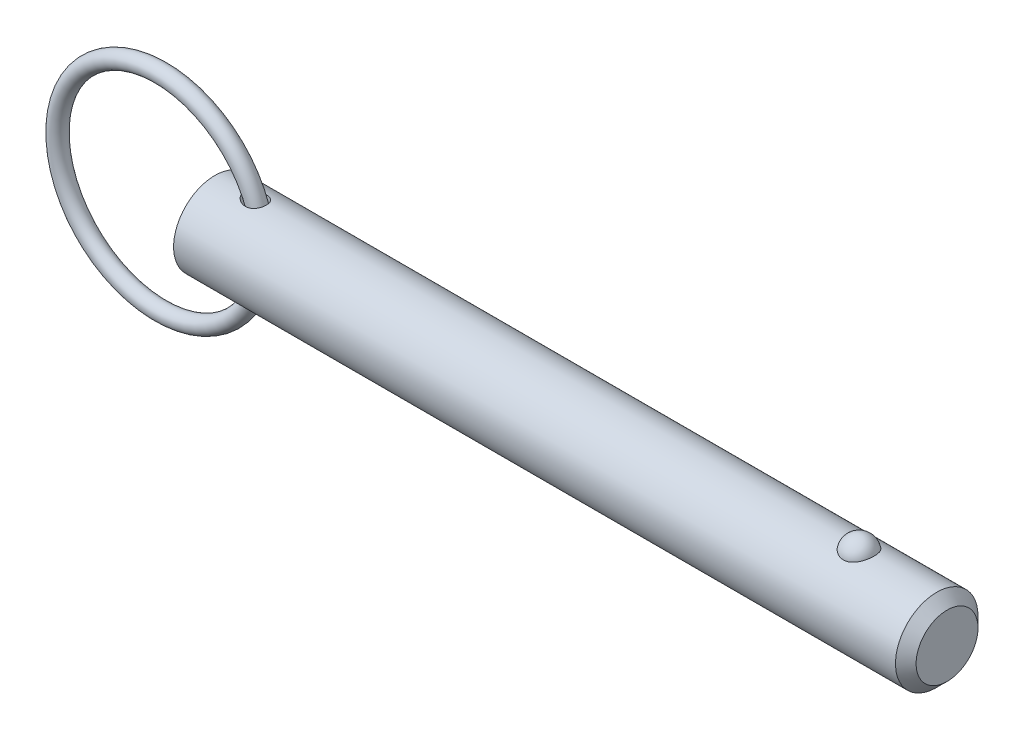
ISO-10303-21;
HEADER;
FILE_DESCRIPTION(('STEP AP214'),'2;1');
FILE_NAME('part.step','',(''),(''),'','','');
FILE_SCHEMA(('AUTOMOTIVE_DESIGN { 1 0 10303 214 1 1 1 1 }'));
ENDSEC;
DATA;
#1=APPLICATION_CONTEXT('core data for automotive mechanical design processes');
#2=APPLICATION_PROTOCOL_DEFINITION('international standard','automotive_design',2000,#1);
#3=PRODUCT_CONTEXT('',#1,'mechanical');
#4=PRODUCT('Part','Part','',(#3));
#5=PRODUCT_RELATED_PRODUCT_CATEGORY('part','',(#4));
#6=PRODUCT_DEFINITION_FORMATION('','',#4);
#7=PRODUCT_DEFINITION_CONTEXT('part definition',#1,'design');
#8=PRODUCT_DEFINITION('design','',#6,#7);
#9=PRODUCT_DEFINITION_SHAPE('','',#8);
#10=(LENGTH_UNIT() NAMED_UNIT(*) SI_UNIT(.MILLI.,.METRE.));
#11=(NAMED_UNIT(*) PLANE_ANGLE_UNIT() SI_UNIT($,.RADIAN.));
#12=(NAMED_UNIT(*) SI_UNIT($,.STERADIAN.) SOLID_ANGLE_UNIT());
#13=UNCERTAINTY_MEASURE_WITH_UNIT(LENGTH_MEASURE(1.E-05),#10,'distance_accuracy_value','');
#14=(GEOMETRIC_REPRESENTATION_CONTEXT(3) GLOBAL_UNCERTAINTY_ASSIGNED_CONTEXT((#13)) GLOBAL_UNIT_ASSIGNED_CONTEXT((#10,
#11,#12)) REPRESENTATION_CONTEXT('',''));
#15=CARTESIAN_POINT('',(0.,0.,0.));
#16=DIRECTION('',(0.,0.,1.));
#17=DIRECTION('',(1.,0.,0.));
#18=AXIS2_PLACEMENT_3D('',#15,#16,#17);
#19=CARTESIAN_POINT('',(-8.34703434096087,0.,0.));
#20=DIRECTION('',(0.,0.,1.));
#21=DIRECTION('',(1.,0.,0.));
#22=AXIS2_PLACEMENT_3D('',#19,#20,#21);
#23=TOROIDAL_SURFACE('',#22,15.875,1.27);
#24=CARTESIAN_POINT('',(8.79796565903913,0.,0.));
#25=VERTEX_POINT('',#24);
#26=VERTEX_LOOP('',#25);
#27=FACE_BOUND('',#26,.T.);
#28=ADVANCED_FACE('P0_F12',(#27),#23,.T.);
#29=CLOSED_SHELL('',(#28));
#30=MANIFOLD_SOLID_BREP('P0_B1',#29);
#31=CARTESIAN_POINT('',(0.,0.,0.));
#32=DIRECTION('',(1.,0.,0.));
#33=DIRECTION('',(0.,0.,-1.));
#34=AXIS2_PLACEMENT_3D('',#31,#32,#33);
#35=CYLINDRICAL_SURFACE('',#34,6.35);
#36=CARTESIAN_POINT('',(4.87230670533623,6.27273159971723,-0.987592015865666));
#37=CARTESIAN_POINT('',(4.94734735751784,6.26035058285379,-1.06623378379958));
#38=CARTESIAN_POINT('',(5.02968768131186,6.24755813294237,-1.13788608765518));
#39=CARTESIAN_POINT('',(5.2053426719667,6.22278258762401,-1.26640223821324));
#40=CARTESIAN_POINT('',(5.29867273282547,6.21080066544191,-1.32324497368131));
#41=CARTESIAN_POINT('',(5.49318962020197,6.18912414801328,-1.42117930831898));
#42=CARTESIAN_POINT('',(5.59435470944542,6.17942350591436,-1.46231273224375));
#43=CARTESIAN_POINT('',(5.80219659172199,6.16352555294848,-1.52793951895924));
#44=CARTESIAN_POINT('',(5.90887152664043,6.15732706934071,-1.55243845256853));
#45=CARTESIAN_POINT('',(6.12818220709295,6.14931784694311,-1.58387975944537));
#46=CARTESIAN_POINT('',(6.24090110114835,6.14763959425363,-1.59029227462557));
#47=CARTESIAN_POINT('',(6.46560233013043,6.14965588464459,-1.58248630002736));
#48=CARTESIAN_POINT('',(6.57758514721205,6.15334646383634,-1.56828303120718));
#49=CARTESIAN_POINT('',(6.78516594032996,6.1652116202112,-1.52091398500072));
#50=CARTESIAN_POINT('',(6.88126802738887,6.17288876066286,-1.48983713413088));
#51=CARTESIAN_POINT('',(7.06576629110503,6.19149190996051,-1.41052329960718));
#52=CARTESIAN_POINT('',(7.15416739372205,6.20241582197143,-1.36229738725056));
#53=CARTESIAN_POINT('',(7.31166929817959,6.2248616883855,-1.25548983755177));
#54=CARTESIAN_POINT('',(7.38181442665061,6.23621734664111,-1.19840625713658));
#55=CARTESIAN_POINT('',(7.51101296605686,6.259037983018,-1.07284763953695));
#56=CARTESIAN_POINT('',(7.57006844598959,6.2705029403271,-1.00437473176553));
#57=CARTESIAN_POINT('',(7.6737469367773,6.29184873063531,-0.860384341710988));
#58=CARTESIAN_POINT('',(7.71876694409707,6.30176816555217,-0.785157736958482));
#59=CARTESIAN_POINT('',(7.79574491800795,6.31935829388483,-0.628053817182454));
#60=CARTESIAN_POINT('',(7.82770308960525,6.32702902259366,-0.546176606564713));
#61=CARTESIAN_POINT('',(7.87788845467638,6.33930929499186,-0.377876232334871));
#62=CARTESIAN_POINT('',(7.89608106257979,6.34391112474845,-0.291442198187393));
#63=CARTESIAN_POINT('',(7.91820729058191,6.34953044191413,-0.116652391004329));
#64=CARTESIAN_POINT('',(7.9221404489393,6.35054781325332,-0.0282965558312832));
#65=CARTESIAN_POINT('',(7.91564686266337,6.34888556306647,0.148263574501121));
#66=CARTESIAN_POINT('',(7.90515337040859,6.34618875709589,0.236465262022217));
#67=CARTESIAN_POINT('',(7.8699153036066,6.33735741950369,0.409798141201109));
#68=CARTESIAN_POINT('',(7.84517062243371,6.33122286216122,0.494929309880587));
#69=CARTESIAN_POINT('',(7.7819985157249,6.31618517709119,0.659657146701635));
#70=CARTESIAN_POINT('',(7.74357645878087,6.30728313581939,0.739255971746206));
#71=CARTESIAN_POINT('',(7.65396632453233,6.28769050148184,0.890663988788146));
#72=CARTESIAN_POINT('',(7.60277911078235,6.27700002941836,0.962473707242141));
#73=CARTESIAN_POINT('',(7.48925881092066,6.2550822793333,1.09590260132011));
#74=CARTESIAN_POINT('',(7.42698604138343,6.24385813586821,1.15757361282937));
#75=CARTESIAN_POINT('',(7.29283556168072,6.2220655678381,1.26951234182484));
#76=CARTESIAN_POINT('',(7.2209588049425,6.21149707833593,1.31978118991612));
#77=CARTESIAN_POINT('',(7.06971853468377,6.19216002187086,1.40772509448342));
#78=CARTESIAN_POINT('',(6.99035873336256,6.18339056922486,1.44540635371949));
#79=CARTESIAN_POINT('',(6.82642723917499,6.16851603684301,1.50762653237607));
#80=CARTESIAN_POINT('',(6.7418548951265,6.16241129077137,1.53216380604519));
#81=CARTESIAN_POINT('',(6.56686412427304,6.15321474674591,1.56869994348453));
#82=CARTESIAN_POINT('',(6.47634467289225,6.15023369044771,1.58023897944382));
#83=CARTESIAN_POINT('',(6.29456956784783,6.14778331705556,1.58974172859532));
#84=CARTESIAN_POINT('',(6.20331368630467,6.1483151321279,1.58770106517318));
#85=CARTESIAN_POINT('',(6.01385969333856,6.15284811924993,1.5700487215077));
#86=CARTESIAN_POINT('',(5.91578322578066,6.15715979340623,1.55322212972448));
#87=CARTESIAN_POINT('',(5.72331909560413,6.16902415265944,1.5054032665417));
#88=CARTESIAN_POINT('',(5.6289344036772,6.17657939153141,1.4743998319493));
#89=CARTESIAN_POINT('',(5.4357260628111,6.19502494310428,1.39499475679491));
#90=CARTESIAN_POINT('',(5.33755891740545,6.20619097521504,1.34505268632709));
#91=CARTESIAN_POINT('',(5.15090047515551,6.23006191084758,1.22975103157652));
#92=CARTESIAN_POINT('',(5.06240741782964,6.24276653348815,1.16439425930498));
#93=CARTESIAN_POINT('',(4.91171642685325,6.26607433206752,1.03083814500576));
#94=CARTESIAN_POINT('',(4.84758224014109,6.27668356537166,0.964825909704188));
#95=CARTESIAN_POINT('',(4.73090054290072,6.29683133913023,0.823112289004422));
#96=CARTESIAN_POINT('',(4.67833688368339,6.30637136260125,0.747424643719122));
#97=CARTESIAN_POINT('',(4.59543145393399,6.32183254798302,0.601150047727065));
#98=CARTESIAN_POINT('',(4.56283099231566,6.32809321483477,0.531883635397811));
#99=CARTESIAN_POINT('',(4.50941370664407,6.33849198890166,0.388778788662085));
#100=CARTESIAN_POINT('',(4.48858876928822,6.34263155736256,0.314943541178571));
#101=CARTESIAN_POINT('',(4.46008864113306,6.3483236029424,0.164282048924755));
#102=CARTESIAN_POINT('',(4.45247558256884,6.34986385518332,0.08744340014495));
#103=CARTESIAN_POINT('',(4.45121096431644,6.35011863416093,-0.0663538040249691));
#104=CARTESIAN_POINT('',(4.45755802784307,6.34883343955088,-0.143312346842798));
#105=CARTESIAN_POINT('',(4.48267656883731,6.34380948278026,-0.288945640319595));
#106=CARTESIAN_POINT('',(4.50045680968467,6.34026665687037,-0.357802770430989));
#107=CARTESIAN_POINT('',(4.54636050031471,6.33128211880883,-0.491815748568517));
#108=CARTESIAN_POINT('',(4.57448566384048,6.32584009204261,-0.556970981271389));
#109=CARTESIAN_POINT('',(4.64209700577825,6.31308107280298,-0.687092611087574));
#110=CARTESIAN_POINT('',(4.68226903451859,6.30565525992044,-0.751689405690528));
#111=CARTESIAN_POINT('',(4.77120834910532,6.28979741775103,-0.874524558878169));
#112=CARTESIAN_POINT('',(4.81998302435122,6.28136452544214,-0.932757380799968));
#113=CARTESIAN_POINT('',(4.87230670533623,6.27273159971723,-0.987592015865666));
#114=B_SPLINE_CURVE_WITH_KNOTS('',3,(#36,#37,#38,#39,#40,#41,#42,#43,#44,#45,#46,#47,#48,#49,
#50,#51,#52,#53,#54,#55,#56,#57,#58,#59,#60,#61,#62,#63,#64,#65,#66,#67,#68,#69,#70,#71,#72,#73,
#74,#75,#76,#77,#78,#79,#80,#81,#82,#83,#84,#85,#86,#87,#88,#89,#90,#91,#92,#93,#94,#95,#96,#97,
#98,#99,#100,#101,#102,#103,#104,#105,#106,#107,#108,#109,#110,#111,#112,#113),.UNSPECIFIED.,
.T.,.F.,(4,2,2,2,2,2,2,2,2,2,2,2,2,2,2,2,2,2,2,2,2,2,2,2,2,2,2,2,2,2,2,2,2,2,2,2,2,2,4),(0.,
0.327902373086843,0.65626964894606,0.983756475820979,1.31113357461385,1.64800657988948,
1.98463099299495,2.28681225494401,2.58879878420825,2.86088594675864,3.13292229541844,
3.3963648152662,3.65980320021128,3.92390128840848,4.18800792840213,4.45334062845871,
4.7186753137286,4.98390596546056,5.24911867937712,5.51293017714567,5.7767155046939,
6.04037065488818,6.30405880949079,6.57680801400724,6.84964512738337,7.14724526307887,
7.44508014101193,7.77572668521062,8.10631295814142,8.38318772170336,8.65967357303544,
8.88915303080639,9.11847418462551,9.34887088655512,9.57924486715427,9.79193291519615,
10.0046562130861,10.2330958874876,10.4617327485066),.UNSPECIFIED.);
#115=CARTESIAN_POINT('',(4.87230670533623,6.27273159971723,-0.987592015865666));
#116=VERTEX_POINT('',#115);
#117=EDGE_CURVE('P1_E40',#116,#116,#114,.T.);
#118=ORIENTED_EDGE('',*,*,#117,.T.);
#119=EDGE_LOOP('',(#118));
#120=FACE_BOUND('',#119,.T.);
#121=CARTESIAN_POINT('',(111.1125,0.,0.));
#122=DIRECTION('',(1.,0.,0.));
#123=DIRECTION('',(0.,0.,-1.));
#124=AXIS2_PLACEMENT_3D('',#121,#122,#123);
#125=CIRCLE('',#124,6.35);
#126=CARTESIAN_POINT('',(111.1125,0.,-6.35));
#127=VERTEX_POINT('',#126);
#128=EDGE_CURVE('P1_E25',#127,#127,#125,.T.);
#129=ORIENTED_EDGE('',*,*,#128,.F.);
#130=EDGE_LOOP('',(#129));
#131=FACE_BOUND('',#130,.T.);
#132=CARTESIAN_POINT('',(0.,0.,0.));
#133=DIRECTION('',(1.,0.,0.));
#134=DIRECTION('',(0.,0.,-1.));
#135=AXIS2_PLACEMENT_3D('',#132,#133,#134);
#136=CIRCLE('',#135,6.35);
#137=CARTESIAN_POINT('',(0.,0.,-6.35));
#138=VERTEX_POINT('',#137);
#139=EDGE_CURVE('P1_E9',#138,#138,#136,.T.);
#140=ORIENTED_EDGE('',*,*,#139,.T.);
#141=EDGE_LOOP('',(#140));
#142=FACE_BOUND('',#141,.T.);
#143=CARTESIAN_POINT('',(99.1500214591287,5.87502187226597,2.40969251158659));
#144=CARTESIAN_POINT('',(99.0250305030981,5.87501645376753,2.40969773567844));
#145=CARTESIAN_POINT('',(98.9000806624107,5.87916061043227,2.39967292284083));
#146=CARTESIAN_POINT('',(98.6539091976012,5.8952311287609,2.35991730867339));
#147=CARTESIAN_POINT('',(98.5326863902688,5.90715499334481,2.33019283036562));
#148=CARTESIAN_POINT('',(98.2975170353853,5.93739567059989,2.25201402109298));
#149=CARTESIAN_POINT('',(98.1835602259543,5.95570321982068,2.2035868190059));
#150=CARTESIAN_POINT('',(97.96557352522,5.99672067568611,2.08937987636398));
#151=CARTESIAN_POINT('',(97.8615457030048,6.01943149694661,2.02359652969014));
#152=CARTESIAN_POINT('',(97.6629437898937,6.06760647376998,1.87428969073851));
#153=CARTESIAN_POINT('',(97.5687268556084,6.09313095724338,1.79031110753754));
#154=CARTESIAN_POINT('',(97.3952557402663,6.14375873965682,1.60800178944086));
#155=CARTESIAN_POINT('',(97.3160043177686,6.16886196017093,1.50966841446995));
#156=CARTESIAN_POINT('',(97.1708457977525,6.21724600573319,1.29645884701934));
#157=CARTESIAN_POINT('',(97.1056885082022,6.24039621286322,1.18104158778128));
#158=CARTESIAN_POINT('',(96.9947035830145,6.28117277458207,0.940351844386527));
#159=CARTESIAN_POINT('',(96.9488776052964,6.29879865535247,0.815078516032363));
#160=CARTESIAN_POINT('',(96.8770234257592,6.32692073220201,0.556494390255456));
#161=CARTESIAN_POINT('',(96.851249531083,6.33732517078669,0.423102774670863));
#162=CARTESIAN_POINT('',(96.8209885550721,6.34957673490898,0.153542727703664));
#163=CARTESIAN_POINT('',(96.8165009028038,6.35142408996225,0.0173743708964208));
#164=CARTESIAN_POINT('',(96.8288655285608,6.34638925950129,-0.253036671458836));
#165=CARTESIAN_POINT('',(96.8455949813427,6.33955731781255,-0.38728593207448));
#166=CARTESIAN_POINT('',(96.899843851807,6.31794129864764,-0.650851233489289));
#167=CARTESIAN_POINT('',(96.9373636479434,6.30315707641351,-0.78016718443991));
#168=CARTESIAN_POINT('',(97.032500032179,6.26711642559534,-1.03041949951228));
#169=CARTESIAN_POINT('',(97.090143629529,6.24585130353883,-1.15134433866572));
#170=CARTESIAN_POINT('',(97.2243522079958,6.19905619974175,-1.38129800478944));
#171=CARTESIAN_POINT('',(97.3009187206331,6.17352587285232,-1.49032586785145));
#172=CARTESIAN_POINT('',(97.4717538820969,6.12080227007,-1.69393164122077));
#173=CARTESIAN_POINT('',(97.5661008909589,6.09360200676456,-1.78844209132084));
#174=CARTESIAN_POINT('',(97.7701196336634,6.04070434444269,-1.95970536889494));
#175=CARTESIAN_POINT('',(97.8797900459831,6.01500681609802,-2.03645972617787));
#176=CARTESIAN_POINT('',(98.1091876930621,5.96867714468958,-2.1684564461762));
#177=CARTESIAN_POINT('',(98.2286522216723,5.94794910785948,-2.2241206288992));
#178=CARTESIAN_POINT('',(98.4762188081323,5.91340580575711,-2.31440992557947));
#179=CARTESIAN_POINT('',(98.6043175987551,5.89958794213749,-2.3490429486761));
#180=CARTESIAN_POINT('',(98.858582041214,5.88111049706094,-2.39491590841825));
#181=CARTESIAN_POINT('',(98.9845207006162,5.876025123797,-2.40724512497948));
#182=CARTESIAN_POINT('',(99.2367867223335,5.87428980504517,-2.41147867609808));
#183=CARTESIAN_POINT('',(99.363114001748,5.87763817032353,-2.40338710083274));
#184=CARTESIAN_POINT('',(99.6084170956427,5.89212921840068,-2.36762715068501));
#185=CARTESIAN_POINT('',(99.7274992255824,5.90302431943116,-2.34058030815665));
#186=CARTESIAN_POINT('',(99.9592447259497,5.93113752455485,-2.26839066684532));
#187=CARTESIAN_POINT('',(100.071907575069,5.94835614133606,-2.22324640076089));
#188=CARTESIAN_POINT('',(100.290400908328,5.98773016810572,-2.11493806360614));
#189=CARTESIAN_POINT('',(100.396028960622,6.00998499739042,-2.05140269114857));
#190=CARTESIAN_POINT('',(100.595300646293,6.05690144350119,-1.90842705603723));
#191=CARTESIAN_POINT('',(100.688941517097,6.08156361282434,-1.8289831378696));
#192=CARTESIAN_POINT('',(100.866675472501,6.13211715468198,-1.65182429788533));
#193=CARTESIAN_POINT('',(100.950055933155,6.15800825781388,-1.55339381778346));
#194=CARTESIAN_POINT('',(101.099790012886,6.20712834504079,-1.34374214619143));
#195=CARTESIAN_POINT('',(101.166140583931,6.23035685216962,-1.23251867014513));
#196=CARTESIAN_POINT('',(101.282345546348,6.27251177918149,-0.996447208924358));
#197=CARTESIAN_POINT('',(101.331607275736,6.29127762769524,-0.871278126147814));
#198=CARTESIAN_POINT('',(101.409614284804,6.3215862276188,-0.613870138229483));
#199=CARTESIAN_POINT('',(101.438359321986,6.33312889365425,-0.481631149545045));
#200=CARTESIAN_POINT('',(101.47477058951,6.34782349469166,-0.213672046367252));
#201=CARTESIAN_POINT('',(101.482413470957,6.35096613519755,-0.0779482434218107));
#202=CARTESIAN_POINT('',(101.476395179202,6.34851322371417,0.192943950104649));
#203=CARTESIAN_POINT('',(101.462734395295,6.3429178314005,0.32811235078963));
#204=CARTESIAN_POINT('',(101.41450361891,6.32360512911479,0.593406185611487));
#205=CARTESIAN_POINT('',(101.380031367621,6.30992579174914,0.723552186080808));
#206=CARTESIAN_POINT('',(101.290953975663,6.27586325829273,0.975834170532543));
#207=CARTESIAN_POINT('',(101.23634761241,6.25547965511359,1.09796966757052));
#208=CARTESIAN_POINT('',(101.10775879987,6.20998183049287,1.33148921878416));
#209=CARTESIAN_POINT('',(101.033674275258,6.18484288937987,1.44281227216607));
#210=CARTESIAN_POINT('',(100.867820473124,6.13258735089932,1.65087683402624));
#211=CARTESIAN_POINT('',(100.776051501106,6.10547078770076,1.74761859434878));
#212=CARTESIAN_POINT('',(100.577183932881,6.0523587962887,1.92350926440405));
#213=CARTESIAN_POINT('',(100.470133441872,6.0263601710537,2.00271146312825));
#214=CARTESIAN_POINT('',(100.243138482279,5.97843747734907,2.14154159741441));
#215=CARTESIAN_POINT('',(100.123191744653,5.95651412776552,2.20116608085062));
#216=CARTESIAN_POINT('',(99.8645236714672,5.91812106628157,2.30250570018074));
#217=CARTESIAN_POINT('',(99.7250698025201,5.90217533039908,2.34256795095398));
#218=CARTESIAN_POINT('',(99.4403974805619,5.88063128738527,2.39615214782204));
#219=CARTESIAN_POINT('',(99.2951817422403,5.8750281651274,2.40968644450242));
#220=CARTESIAN_POINT('',(99.1500214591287,5.87502187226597,2.40969251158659));
#221=B_SPLINE_CURVE_WITH_KNOTS('',3,(#143,#144,#145,#146,#147,#148,#149,#150,#151,#152,#153,
#154,#155,#156,#157,#158,#159,#160,#161,#162,#163,#164,#165,#166,#167,#168,#169,#170,#171,#172,
#173,#174,#175,#176,#177,#178,#179,#180,#181,#182,#183,#184,#185,#186,#187,#188,#189,#190,#191,
#192,#193,#194,#195,#196,#197,#198,#199,#200,#201,#202,#203,#204,#205,#206,#207,#208,#209,#210,
#211,#212,#213,#214,#215,#216,#217,#218,#219,#220),.UNSPECIFIED.,.T.,.F.,(4,2,2,2,2,2,2,2,2,2,2,
2,2,2,2,2,2,2,2,2,2,2,2,2,2,2,2,2,2,2,2,2,2,2,2,2,2,2,4),(0.,0.374440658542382,
0.748761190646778,1.12254078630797,1.49639810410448,1.88098871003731,2.26565013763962,
2.66741104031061,3.06920639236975,3.47601794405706,3.88281858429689,4.28727498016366,
4.69173873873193,5.09674745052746,5.50178895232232,5.90865911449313,6.31549420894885,
6.71369855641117,7.11175305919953,7.48978077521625,7.86773278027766,8.23383886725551,
8.59997464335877,8.97409044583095,9.34829231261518,9.74122667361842,10.1342313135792,
10.5397522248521,10.9452779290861,11.3512521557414,11.7572189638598,12.1612938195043,
12.5653932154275,12.9716540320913,13.3779078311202,13.7829098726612,14.1879832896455,
14.6230486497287,15.0579114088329),.UNSPECIFIED.);
#222=CARTESIAN_POINT('',(99.1500214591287,5.87502187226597,2.40969251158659));
#223=VERTEX_POINT('',#222);
#224=EDGE_CURVE('P1_E34',#223,#223,#221,.T.);
#225=ORIENTED_EDGE('',*,*,#224,.T.);
#226=EDGE_LOOP('',(#225));
#227=FACE_BOUND('',#226,.T.);
#228=CARTESIAN_POINT('',(4.87230670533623,-6.27273159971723,-0.987592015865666));
#229=CARTESIAN_POINT('',(4.81440819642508,-6.28228431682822,-0.926913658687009));
#230=CARTESIAN_POINT('',(4.76085022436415,-6.29159289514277,-0.862071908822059));
#231=CARTESIAN_POINT('',(4.66448472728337,-6.3088950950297,-0.72465504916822));
#232=CARTESIAN_POINT('',(4.62166818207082,-6.31688981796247,-0.652086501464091));
#233=CARTESIAN_POINT('',(4.54882773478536,-6.33076917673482,-0.49974775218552));
#234=CARTESIAN_POINT('',(4.51891553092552,-6.33663532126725,-0.419921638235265));
#235=CARTESIAN_POINT('',(4.47476924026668,-6.3453711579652,-0.255882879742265));
#236=CARTESIAN_POINT('',(4.46051880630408,-6.34824397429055,-0.171674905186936));
#237=CARTESIAN_POINT('',(4.44966179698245,-6.35043041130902,-0.0120763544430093));
#238=CARTESIAN_POINT('',(4.45117530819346,-6.35012328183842,0.0631849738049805));
#239=CARTESIAN_POINT('',(4.46726452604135,-6.34689000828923,0.212230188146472));
#240=CARTESIAN_POINT('',(4.48184026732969,-6.3439638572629,0.286014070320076));
#241=CARTESIAN_POINT('',(4.52202068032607,-6.33603071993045,0.426550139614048));
#242=CARTESIAN_POINT('',(4.54707079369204,-6.33112875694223,0.493469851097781));
#243=CARTESIAN_POINT('',(4.6066985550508,-6.31972370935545,0.622743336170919));
#244=CARTESIAN_POINT('',(4.64127887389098,-6.31322017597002,0.685095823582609));
#245=CARTESIAN_POINT('',(4.72328142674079,-6.29826068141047,0.811769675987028));
#246=CARTESIAN_POINT('',(4.77176118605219,-6.28966287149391,0.875386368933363));
#247=CARTESIAN_POINT('',(4.87703902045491,-6.27182325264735,0.99519278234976));
#248=CARTESIAN_POINT('',(4.93384225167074,-6.26258104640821,1.05137785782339));
#249=CARTESIAN_POINT('',(5.06617436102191,-6.24228878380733,1.16635591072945));
#250=CARTESIAN_POINT('',(5.14318167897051,-6.23124423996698,1.22345054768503));
#251=CARTESIAN_POINT('',(5.30475767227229,-6.21023402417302,1.32598441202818));
#252=CARTESIAN_POINT('',(5.38933237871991,-6.20026922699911,1.37141422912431));
#253=CARTESIAN_POINT('',(5.5776013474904,-6.18099350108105,1.45601817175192));
#254=CARTESIAN_POINT('',(5.68224348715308,-6.17201456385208,1.4931788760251));
#255=CARTESIAN_POINT('',(5.89649087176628,-6.15800474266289,1.5499484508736));
#256=CARTESIAN_POINT('',(6.0060970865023,-6.15297463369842,1.56955387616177));
#257=CARTESIAN_POINT('',(6.22752772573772,-6.14779725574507,1.58971993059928));
#258=CARTESIAN_POINT('',(6.33935715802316,-6.14766266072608,1.59023112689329));
#259=CARTESIAN_POINT('',(6.56108231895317,-6.15269227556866,1.57066564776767));
#260=CARTESIAN_POINT('',(6.67097982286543,-6.15785133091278,1.55060899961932));
#261=CARTESIAN_POINT('',(6.87257705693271,-6.17211580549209,1.4927326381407));
#262=CARTESIAN_POINT('',(6.96494608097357,-6.18072242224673,1.45711948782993));
#263=CARTESIAN_POINT('',(7.14129343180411,-6.20069920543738,1.36960980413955));
#264=CARTESIAN_POINT('',(7.22527609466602,-6.21206793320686,1.31772174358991));
#265=CARTESIAN_POINT('',(7.37471505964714,-6.23497047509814,1.20443359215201));
#266=CARTESIAN_POINT('',(7.44115811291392,-6.24639757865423,1.14430788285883));
#267=CARTESIAN_POINT('',(7.56261868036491,-6.26896339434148,1.0134084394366));
#268=CARTESIAN_POINT('',(7.61763801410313,-6.28010215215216,0.942636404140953));
#269=CARTESIAN_POINT('',(7.71360563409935,-6.30055923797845,0.794304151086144));
#270=CARTESIAN_POINT('',(7.75485562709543,-6.3099143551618,0.716943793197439));
#271=CARTESIAN_POINT('',(7.82406051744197,-6.32610528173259,0.556244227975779));
#272=CARTESIAN_POINT('',(7.85201540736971,-6.33294108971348,0.472905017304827));
#273=CARTESIAN_POINT('',(7.89408663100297,-6.34338077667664,0.302249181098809));
#274=CARTESIAN_POINT('',(7.90814615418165,-6.34697138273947,0.214917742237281));
#275=CARTESIAN_POINT('',(7.92192329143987,-6.35048887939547,0.0390564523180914));
#276=CARTESIAN_POINT('',(7.92164046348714,-6.3504156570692,-0.0494734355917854));
#277=CARTESIAN_POINT('',(7.90670754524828,-6.34660520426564,-0.225592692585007));
#278=CARTESIAN_POINT('',(7.89199989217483,-6.34285329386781,-0.31317687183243));
#279=CARTESIAN_POINT('',(7.8484534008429,-6.33206809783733,-0.484549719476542));
#280=CARTESIAN_POINT('',(7.81961455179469,-6.32503480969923,-0.568338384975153));
#281=CARTESIAN_POINT('',(7.74850591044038,-6.30846389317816,-0.729625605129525));
#282=CARTESIAN_POINT('',(7.70625193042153,-6.29892921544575,-0.807131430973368));
#283=CARTESIAN_POINT('',(7.60933437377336,-6.27840608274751,-0.953731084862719));
#284=CARTESIAN_POINT('',(7.55467181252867,-6.2674177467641,-1.02282560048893));
#285=CARTESIAN_POINT('',(7.43471786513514,-6.24527869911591,-1.15028913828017));
#286=CARTESIAN_POINT('',(7.36948829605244,-6.23412925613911,-1.20871657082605));
#287=CARTESIAN_POINT('',(7.2300172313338,-6.21283678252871,-1.3137894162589));
#288=CARTESIAN_POINT('',(7.15577649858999,-6.20269366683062,-1.36043582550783));
#289=CARTESIAN_POINT('',(7.00025986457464,-6.18446636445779,-1.4410399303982));
#290=CARTESIAN_POINT('',(6.91896776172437,-6.17638709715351,-1.47496739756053));
#291=CARTESIAN_POINT('',(6.75184232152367,-6.16309237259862,-1.52957024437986));
#292=CARTESIAN_POINT('',(6.66600814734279,-6.15787744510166,-1.55024317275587));
#293=CARTESIAN_POINT('',(6.48842585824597,-6.15055064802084,-1.57906962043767));
#294=CARTESIAN_POINT('',(6.39658108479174,-6.14857915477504,-1.58665744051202));
#295=CARTESIAN_POINT('',(6.21279832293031,-6.14817707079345,-1.58821048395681));
#296=CARTESIAN_POINT('',(6.12086031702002,-6.14974736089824,-1.58217231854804));
#297=CARTESIAN_POINT('',(5.92996902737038,-6.15640095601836,-1.55609403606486));
#298=CARTESIAN_POINT('',(5.83120653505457,-6.16181208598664,-1.53474519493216));
#299=CARTESIAN_POINT('',(5.63804881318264,-6.17573474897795,-1.47771859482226));
#300=CARTESIAN_POINT('',(5.54365953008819,-6.18425037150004,-1.44202192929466));
#301=CARTESIAN_POINT('',(5.34413923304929,-6.20522938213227,-1.34918979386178));
#302=CARTESIAN_POINT('',(5.24033140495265,-6.21813417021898,-1.28928337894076));
#303=CARTESIAN_POINT('',(5.04554233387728,-6.24510162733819,-1.15156760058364));
#304=CARTESIAN_POINT('',(4.9545459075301,-6.25916289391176,-1.07377972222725));
#305=CARTESIAN_POINT('',(4.87230670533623,-6.27273159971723,-0.987592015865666));
#306=B_SPLINE_CURVE_WITH_KNOTS('',3,(#228,#229,#230,#231,#232,#233,#234,#235,#236,#237,#238,
#239,#240,#241,#242,#243,#244,#245,#246,#247,#248,#249,#250,#251,#252,#253,#254,#255,#256,#257,
#258,#259,#260,#261,#262,#263,#264,#265,#266,#267,#268,#269,#270,#271,#272,#273,#274,#275,#276,
#277,#278,#279,#280,#281,#282,#283,#284,#285,#286,#287,#288,#289,#290,#291,#292,#293,#294,#295,
#296,#297,#298,#299,#300,#301,#302,#303,#304,#305),.UNSPECIFIED.,.T.,.F.,(4,2,2,2,2,2,2,2,2,2,2,
2,2,2,2,2,2,2,2,2,2,2,2,2,2,2,2,2,2,2,2,2,2,2,2,2,2,2,4),(0.,0.252951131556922,
0.505689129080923,0.760572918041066,1.01519041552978,1.23982791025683,1.46446600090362,
1.67847364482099,1.89254132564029,2.13299551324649,2.37359928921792,2.6619896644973,
2.95061196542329,3.28329078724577,3.61603488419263,3.9496403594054,4.28292130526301,
4.57939201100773,4.87570862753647,5.14538810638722,5.41502459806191,5.67829123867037,
5.94155802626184,6.20589676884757,6.47024365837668,6.73564974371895,7.00105603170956,
7.26615064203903,7.53122356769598,7.79479837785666,8.05835088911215,8.32252586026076,
8.58674967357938,8.86213419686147,9.137587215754,9.43991696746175,9.74264642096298,
10.1023688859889,10.461661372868),.UNSPECIFIED.);
#307=CARTESIAN_POINT('',(4.87230670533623,-6.27273159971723,-0.987592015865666));
#308=VERTEX_POINT('',#307);
#309=EDGE_CURVE('P1_E17',#308,#308,#306,.T.);
#310=ORIENTED_EDGE('',*,*,#309,.T.);
#311=EDGE_LOOP('',(#310));
#312=FACE_BOUND('',#311,.T.);
#313=ADVANCED_FACE('P1_F13',(#120,#131,#142,#227,#312),#35,.T.);
#314=CARTESIAN_POINT('',(0.,0.,0.));
#315=DIRECTION('',(-1.,0.,0.));
#316=DIRECTION('',(0.,0.,1.));
#317=AXIS2_PLACEMENT_3D('',#314,#315,#316);
#318=PLANE('',#317);
#319=ORIENTED_EDGE('',*,*,#139,.F.);
#320=EDGE_LOOP('',(#319));
#321=FACE_BOUND('',#320,.T.);
#322=ADVANCED_FACE('P1_F15',(#321),#318,.T.);
#323=CARTESIAN_POINT('',(112.7,0.,0.));
#324=DIRECTION('',(-1.,0.,0.));
#325=DIRECTION('',(0.,0.,1.));
#326=AXIS2_PLACEMENT_3D('',#323,#324,#325);
#327=CONICAL_SURFACE('',#326,4.76250000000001,0.785398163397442);
#328=ORIENTED_EDGE('',*,*,#128,.T.);
#329=EDGE_LOOP('',(#328));
#330=FACE_BOUND('',#329,.T.);
#331=CARTESIAN_POINT('',(112.7,0.,0.));
#332=DIRECTION('',(1.,0.,0.));
#333=DIRECTION('',(0.,0.,-1.));
#334=AXIS2_PLACEMENT_3D('',#331,#332,#333);
#335=CIRCLE('',#334,4.76250000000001);
#336=CARTESIAN_POINT('',(112.7,0.,-4.76250000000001));
#337=VERTEX_POINT('',#336);
#338=EDGE_CURVE('P1_E30',#337,#337,#335,.T.);
#339=ORIENTED_EDGE('',*,*,#338,.F.);
#340=EDGE_LOOP('',(#339));
#341=FACE_BOUND('',#340,.T.);
#342=ADVANCED_FACE('P1_F55',(#330,#341),#327,.T.);
#343=CARTESIAN_POINT('',(112.7,4.76250000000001,0.));
#344=DIRECTION('',(1.,0.,0.));
#345=DIRECTION('',(0.,0.,-1.));
#346=AXIS2_PLACEMENT_3D('',#343,#344,#345);
#347=PLANE('',#346);
#348=ORIENTED_EDGE('',*,*,#338,.T.);
#349=EDGE_LOOP('',(#348));
#350=FACE_BOUND('',#349,.T.);
#351=ADVANCED_FACE('P1_F51',(#350),#347,.T.);
#352=CARTESIAN_POINT('',(99.1500214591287,5.715,0.));
#353=DIRECTION('',(-1.,0.,0.));
#354=DIRECTION('',(0.,1.,0.));
#355=AXIS2_PLACEMENT_3D('',#352,#353,#354);
#356=SPHERICAL_SURFACE('',#355,2.415);
#357=ORIENTED_EDGE('',*,*,#224,.F.);
#358=EDGE_LOOP('',(#357));
#359=FACE_BOUND('',#358,.T.);
#360=ADVANCED_FACE('P1_F46',(#359),#356,.T.);
#361=CARTESIAN_POINT('',(-8.34703434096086,0.,0.));
#362=DIRECTION('',(0.,0.,1.));
#363=DIRECTION('',(1.,0.,0.));
#364=AXIS2_PLACEMENT_3D('',#361,#362,#363);
#365=TOROIDAL_SURFACE('',#364,15.875,1.5875);
#366=ORIENTED_EDGE('',*,*,#309,.F.);
#367=EDGE_LOOP('',(#366));
#368=FACE_BOUND('',#367,.T.);
#369=ORIENTED_EDGE('',*,*,#117,.F.);
#370=EDGE_LOOP('',(#369));
#371=FACE_BOUND('',#370,.T.);
#372=ADVANCED_FACE('P1_F50',(#368,#371),#365,.F.);
#373=CLOSED_SHELL('',(#313,#322,#342,#351,#360,#372));
#374=MANIFOLD_SOLID_BREP('P1_B1',#373);
#375=ADVANCED_BREP_SHAPE_REPRESENTATION('',(#18,#30,#374),#14);
#376=SHAPE_DEFINITION_REPRESENTATION(#9,#375);
ENDSEC;
END-ISO-10303-21;
